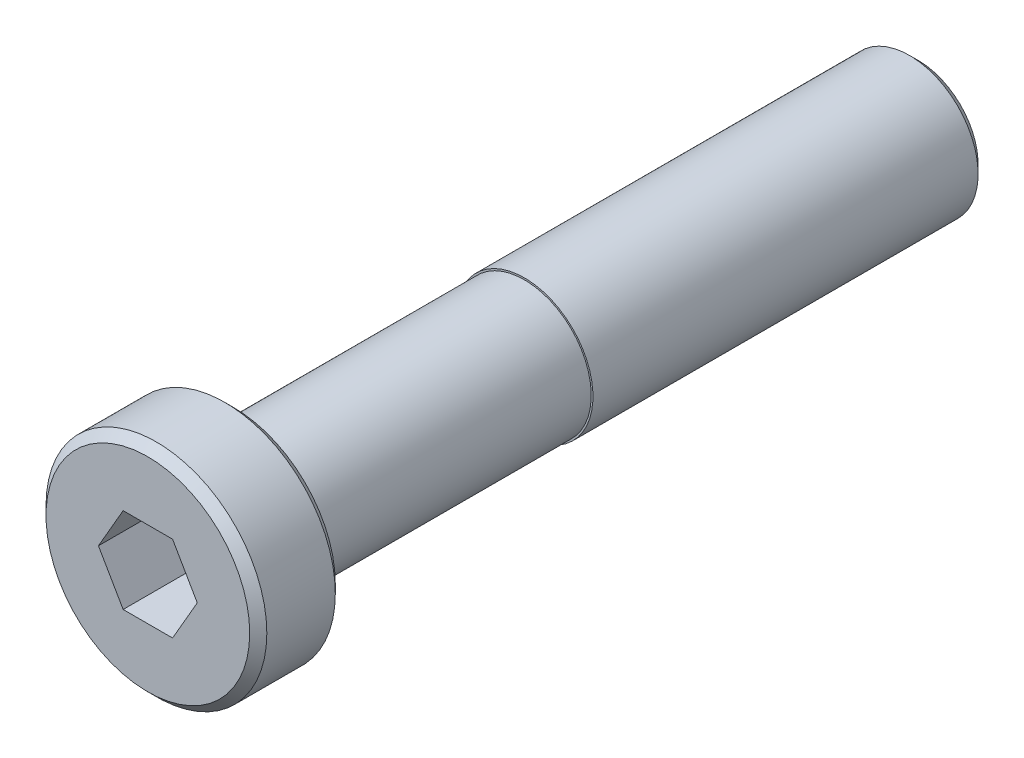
from build123d import *

# Parameters (mm, degrees)
SKETCH_1_R                = 6.45
EXTRUDE_1_DEPTH           = 5
SKETCH_2_R                = 3.9
EXTRUDE_2_DEPTH           = 40
CUT_EXTRUDE_1_DEPTH       = 3.8
HOLE_WIZARD_5_0_5_1_D     = 5
HOLE_WIZARD_5_0_5_1_DEPTH = 3.8
HOLE_WIZARD_5_0_5_1_TIP   = 1.502151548
CHAMFER_2_SIZE            = 0.5
SKETCH_7_R                = 4
EXTRUDE_3_DEPTH           = 23
CHAMFER_1_SIZE            = 0.5


with BuildPart() as part:
    # Sketch 1 → Extrude 1 (new body)
    with BuildSketch(Plane.XY):
        Circle(SKETCH_1_R)
    extrude(amount=EXTRUDE_1_DEPTH)

    # Sketch 2 → Extrude 2 (add)
    with BuildSketch(Plane(origin=(0, 0, 0), x_dir=(-1, 0, 0), z_dir=(0, 0, -1))):
        Circle(SKETCH_2_R)
    extrude(amount=EXTRUDE_2_DEPTH)

    # Sketch 3 → Cut-Extrude 1 (cut)
    with BuildSketch(Plane.XY.offset(5)):
        Polygon((2.886751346, 0), (1.443375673, 2.5), (-1.443375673, 2.5), (-2.886751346, 0), (-1.443375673, -2.5), (1.443375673, -2.5), align=None)
    extrude(amount=-CUT_EXTRUDE_1_DEPTH, mode=Mode.SUBTRACT)

    # Hole Wizard 5.0 _5_ _1
    with Locations(Plane.XY.offset(5)):
        with Locations((0, 0)):
            Hole(HOLE_WIZARD_5_0_5_1_D / 2, depth=HOLE_WIZARD_5_0_5_1_DEPTH)
            with Locations((0, 0, -(HOLE_WIZARD_5_0_5_1_DEPTH + HOLE_WIZARD_5_0_5_1_TIP / 2))):  # 118° drill point
                Cone(0, HOLE_WIZARD_5_0_5_1_D / 2, HOLE_WIZARD_5_0_5_1_TIP, mode=Mode.SUBTRACT)

    # Chamfer 2
    chamfer_2_edges = [part.edges().sort_by_distance(p)[0] for p in [
        (-6.45, 0, 0),
        (-6.45, 0, 5),
    ]]
    chamfer(chamfer_2_edges, length=CHAMFER_2_SIZE)

    # Sketch 7 → Extrude 3 (add)
    with BuildSketch(Plane(origin=(0, 0, -40), x_dir=(-1, 0, 0), z_dir=(0, 0, -1))):
        Circle(SKETCH_7_R)
    extrude(amount=-EXTRUDE_3_DEPTH)

    # Chamfer 1
    chamfer_1_edges = [part.edges().sort_by_distance(p)[0] for p in [
        (4, 0, -40),
    ]]
    chamfer(chamfer_1_edges, length=CHAMFER_1_SIZE)


solid = part.part
